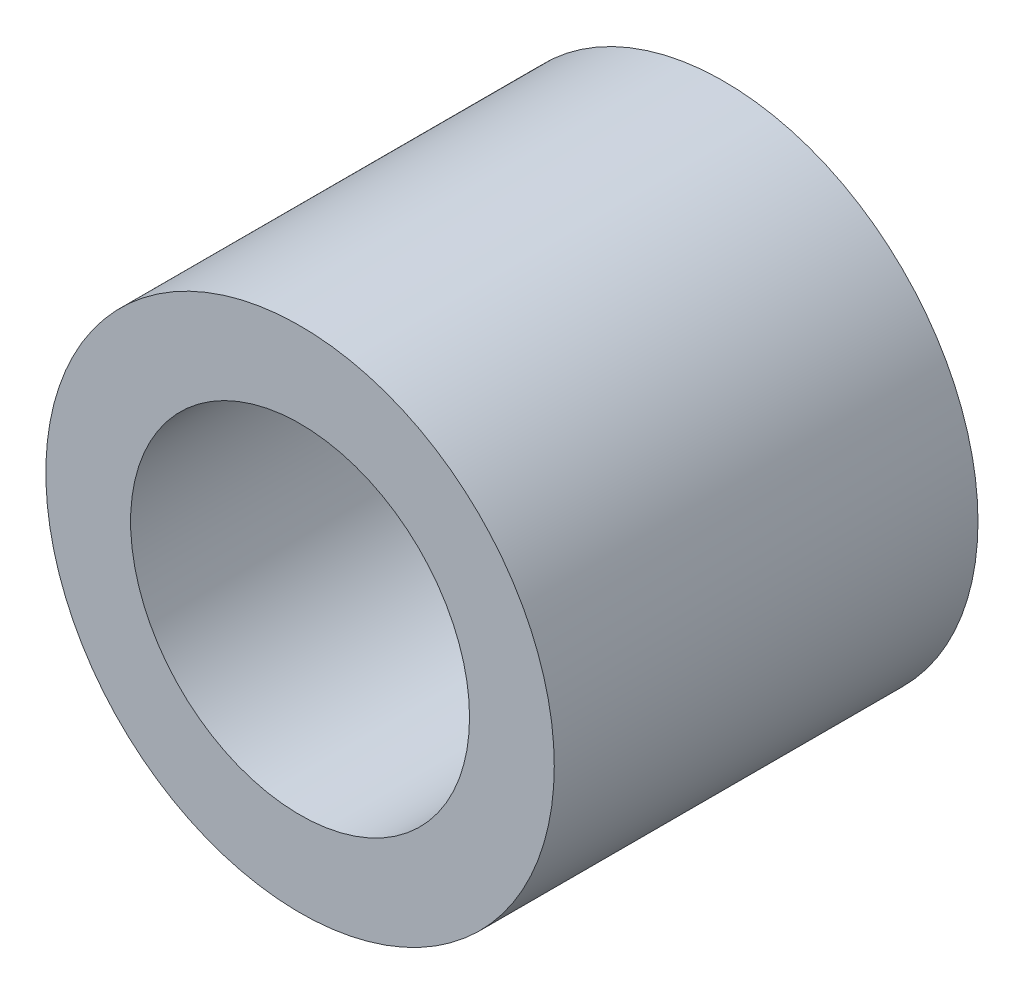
ISO-10303-21;
HEADER;
FILE_DESCRIPTION(('STEP AP214'),'2;1');
FILE_NAME('part.step','',(''),(''),'','','');
FILE_SCHEMA(('AUTOMOTIVE_DESIGN { 1 0 10303 214 1 1 1 1 }'));
ENDSEC;
DATA;
#1=APPLICATION_CONTEXT('core data for automotive mechanical design processes');
#2=APPLICATION_PROTOCOL_DEFINITION('international standard','automotive_design',2000,#1);
#3=PRODUCT_CONTEXT('',#1,'mechanical');
#4=PRODUCT('Part','Part','',(#3));
#5=PRODUCT_RELATED_PRODUCT_CATEGORY('part','',(#4));
#6=PRODUCT_DEFINITION_FORMATION('','',#4);
#7=PRODUCT_DEFINITION_CONTEXT('part definition',#1,'design');
#8=PRODUCT_DEFINITION('design','',#6,#7);
#9=PRODUCT_DEFINITION_SHAPE('','',#8);
#10=(LENGTH_UNIT() NAMED_UNIT(*) SI_UNIT(.MILLI.,.METRE.));
#11=(NAMED_UNIT(*) PLANE_ANGLE_UNIT() SI_UNIT($,.RADIAN.));
#12=(NAMED_UNIT(*) SI_UNIT($,.STERADIAN.) SOLID_ANGLE_UNIT());
#13=UNCERTAINTY_MEASURE_WITH_UNIT(LENGTH_MEASURE(1.E-05),#10,'distance_accuracy_value','');
#14=(GEOMETRIC_REPRESENTATION_CONTEXT(3) GLOBAL_UNCERTAINTY_ASSIGNED_CONTEXT((#13)) GLOBAL_UNIT_ASSIGNED_CONTEXT((#10,
#11,#12)) REPRESENTATION_CONTEXT('',''));
#15=CARTESIAN_POINT('',(0.,0.,0.));
#16=DIRECTION('',(0.,0.,1.));
#17=DIRECTION('',(1.,0.,0.));
#18=AXIS2_PLACEMENT_3D('',#15,#16,#17);
#19=CARTESIAN_POINT('',(0.,0.,75.));
#20=DIRECTION('',(0.,0.,1.));
#21=DIRECTION('',(1.,0.,0.));
#22=AXIS2_PLACEMENT_3D('',#19,#20,#21);
#23=PLANE('',#22);
#24=CARTESIAN_POINT('',(0.,0.,75.));
#25=DIRECTION('',(0.,0.,1.));
#26=DIRECTION('',(1.,0.,0.));
#27=AXIS2_PLACEMENT_3D('',#24,#25,#26);
#28=CIRCLE('',#27,45.);
#29=CARTESIAN_POINT('',(45.,0.,75.));
#30=VERTEX_POINT('',#29);
#31=EDGE_CURVE('E10',#30,#30,#28,.T.);
#32=ORIENTED_EDGE('',*,*,#31,.T.);
#33=EDGE_LOOP('',(#32));
#34=FACE_BOUND('',#33,.T.);
#35=CARTESIAN_POINT('',(0.,0.,75.));
#36=DIRECTION('',(0.,0.,1.));
#37=DIRECTION('',(1.,0.,0.));
#38=AXIS2_PLACEMENT_3D('',#35,#36,#37);
#39=CIRCLE('',#38,30.);
#40=CARTESIAN_POINT('',(30.,0.,75.));
#41=VERTEX_POINT('',#40);
#42=EDGE_CURVE('E43',#41,#41,#39,.T.);
#43=ORIENTED_EDGE('',*,*,#42,.F.);
#44=EDGE_LOOP('',(#43));
#45=FACE_BOUND('',#44,.T.);
#46=ADVANCED_FACE('F32',(#34,#45),#23,.T.);
#47=CARTESIAN_POINT('',(0.,0.,0.));
#48=DIRECTION('',(0.,0.,1.));
#49=DIRECTION('',(1.,0.,0.));
#50=AXIS2_PLACEMENT_3D('',#47,#48,#49);
#51=PLANE('',#50);
#52=CARTESIAN_POINT('',(0.,0.,0.));
#53=DIRECTION('',(0.,0.,1.));
#54=DIRECTION('',(1.,0.,0.));
#55=AXIS2_PLACEMENT_3D('',#52,#53,#54);
#56=CIRCLE('',#55,45.);
#57=CARTESIAN_POINT('',(45.,0.,0.));
#58=VERTEX_POINT('',#57);
#59=EDGE_CURVE('E36',#58,#58,#56,.T.);
#60=ORIENTED_EDGE('',*,*,#59,.F.);
#61=EDGE_LOOP('',(#60));
#62=FACE_BOUND('',#61,.T.);
#63=CARTESIAN_POINT('',(0.,0.,0.));
#64=DIRECTION('',(0.,0.,1.));
#65=DIRECTION('',(1.,0.,0.));
#66=AXIS2_PLACEMENT_3D('',#63,#64,#65);
#67=CIRCLE('',#66,30.);
#68=CARTESIAN_POINT('',(30.,0.,0.));
#69=VERTEX_POINT('',#68);
#70=EDGE_CURVE('E45',#69,#69,#67,.T.);
#71=ORIENTED_EDGE('',*,*,#70,.T.);
#72=EDGE_LOOP('',(#71));
#73=FACE_BOUND('',#72,.T.);
#74=ADVANCED_FACE('F55',(#62,#73),#51,.F.);
#75=CARTESIAN_POINT('',(0.,0.,75.));
#76=DIRECTION('',(0.,0.,-1.));
#77=DIRECTION('',(-1.,0.,0.));
#78=AXIS2_PLACEMENT_3D('',#75,#76,#77);
#79=CYLINDRICAL_SURFACE('',#78,45.);
#80=ORIENTED_EDGE('',*,*,#31,.F.);
#81=EDGE_LOOP('',(#80));
#82=FACE_BOUND('',#81,.T.);
#83=ORIENTED_EDGE('',*,*,#59,.T.);
#84=EDGE_LOOP('',(#83));
#85=FACE_BOUND('',#84,.T.);
#86=ADVANCED_FACE('F34',(#82,#85),#79,.T.);
#87=CARTESIAN_POINT('',(0.,0.,75.));
#88=DIRECTION('',(0.,0.,-1.));
#89=DIRECTION('',(-1.,0.,0.));
#90=AXIS2_PLACEMENT_3D('',#87,#88,#89);
#91=CYLINDRICAL_SURFACE('',#90,30.);
#92=ORIENTED_EDGE('',*,*,#42,.T.);
#93=EDGE_LOOP('',(#92));
#94=FACE_BOUND('',#93,.T.);
#95=ORIENTED_EDGE('',*,*,#70,.F.);
#96=EDGE_LOOP('',(#95));
#97=FACE_BOUND('',#96,.T.);
#98=ADVANCED_FACE('F51',(#94,#97),#91,.F.);
#99=CLOSED_SHELL('',(#46,#74,#86,#98));
#100=MANIFOLD_SOLID_BREP('B2',#99);
#101=ADVANCED_BREP_SHAPE_REPRESENTATION('',(#18,#100),#14);
#102=SHAPE_DEFINITION_REPRESENTATION(#9,#101);
ENDSEC;
END-ISO-10303-21;
